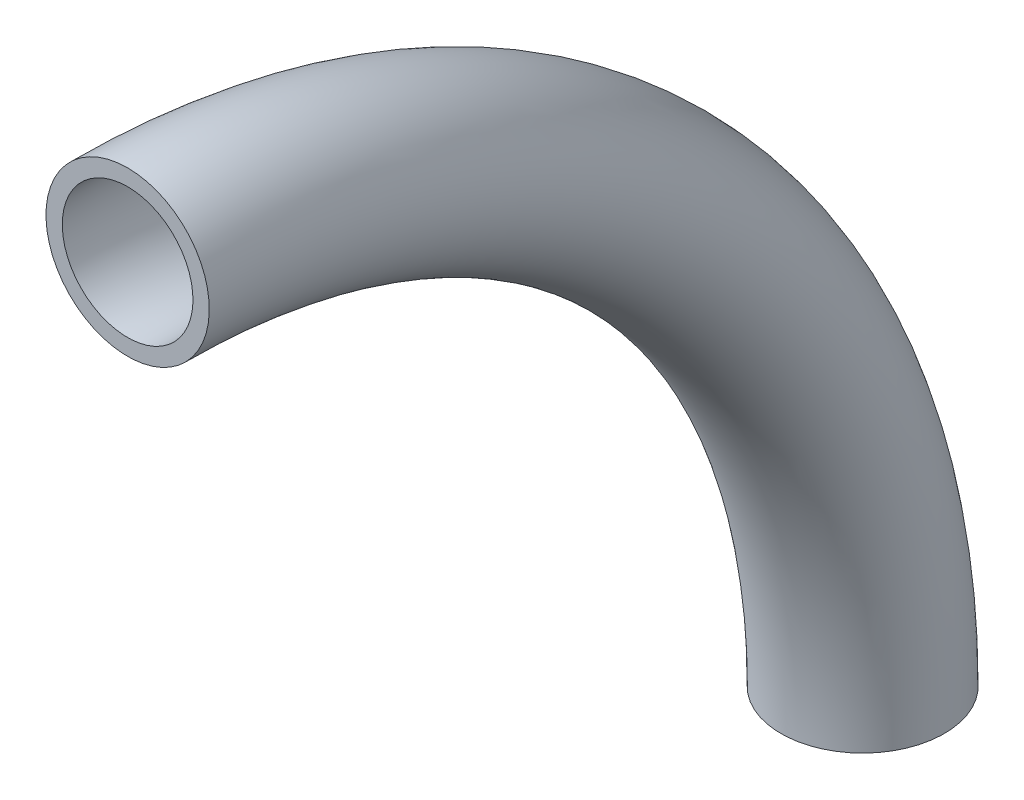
ISO-10303-21;
HEADER;
FILE_DESCRIPTION(('STEP AP214'),'2;1');
FILE_NAME('part.step','',(''),(''),'','','');
FILE_SCHEMA(('AUTOMOTIVE_DESIGN { 1 0 10303 214 1 1 1 1 }'));
ENDSEC;
DATA;
#1=APPLICATION_CONTEXT('core data for automotive mechanical design processes');
#2=APPLICATION_PROTOCOL_DEFINITION('international standard','automotive_design',2000,#1);
#3=PRODUCT_CONTEXT('',#1,'mechanical');
#4=PRODUCT('Part','Part','',(#3));
#5=PRODUCT_RELATED_PRODUCT_CATEGORY('part','',(#4));
#6=PRODUCT_DEFINITION_FORMATION('','',#4);
#7=PRODUCT_DEFINITION_CONTEXT('part definition',#1,'design');
#8=PRODUCT_DEFINITION('design','',#6,#7);
#9=PRODUCT_DEFINITION_SHAPE('','',#8);
#10=(LENGTH_UNIT() NAMED_UNIT(*) SI_UNIT(.MILLI.,.METRE.));
#11=(NAMED_UNIT(*) PLANE_ANGLE_UNIT() SI_UNIT($,.RADIAN.));
#12=(NAMED_UNIT(*) SI_UNIT($,.STERADIAN.) SOLID_ANGLE_UNIT());
#13=UNCERTAINTY_MEASURE_WITH_UNIT(LENGTH_MEASURE(1.E-05),#10,'distance_accuracy_value','');
#14=(GEOMETRIC_REPRESENTATION_CONTEXT(3) GLOBAL_UNCERTAINTY_ASSIGNED_CONTEXT((#13)) GLOBAL_UNIT_ASSIGNED_CONTEXT((#10,
#11,#12)) REPRESENTATION_CONTEXT('',''));
#15=CARTESIAN_POINT('',(0.,0.,0.));
#16=DIRECTION('',(0.,0.,1.));
#17=DIRECTION('',(1.,0.,0.));
#18=AXIS2_PLACEMENT_3D('',#15,#16,#17);
#19=CARTESIAN_POINT('',(0.,0.,4.5));
#20=DIRECTION('',(-1.,0.,0.));
#21=DIRECTION('',(0.,0.,1.));
#22=AXIS2_PLACEMENT_3D('',#19,#20,#21);
#23=TOROIDAL_SURFACE('',#22,4.5,0.5);
#24=CARTESIAN_POINT('',(0.,4.5,4.50000000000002));
#25=DIRECTION('',(0.,0.,1.));
#26=DIRECTION('',(0.,-1.,0.));
#27=AXIS2_PLACEMENT_3D('',#24,#25,#26);
#28=CIRCLE('',#27,0.5);
#29=CARTESIAN_POINT('',(0.,5.,4.50000000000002));
#30=VERTEX_POINT('',#29);
#31=EDGE_CURVE('E38',#30,#30,#28,.T.);
#32=CARTESIAN_POINT('',(0.,0.,0.));
#33=DIRECTION('',(0.,1.,0.));
#34=DIRECTION('',(0.,0.,1.));
#35=AXIS2_PLACEMENT_3D('',#32,#33,#34);
#36=CIRCLE('',#35,0.5);
#37=CARTESIAN_POINT('',(0.,0.,-0.5));
#38=VERTEX_POINT('',#37);
#39=EDGE_CURVE('E46',#38,#38,#36,.T.);
#40=CARTESIAN_POINT('',(0.,0.,4.5));
#41=DIRECTION('',(-1.,0.,0.));
#42=DIRECTION('',(0.,0.,1.));
#43=AXIS2_PLACEMENT_3D('',#40,#41,#42);
#44=CIRCLE('',#43,5.);
#45=EDGE_CURVE('',#30,#38,#44,.T.);
#46=ORIENTED_EDGE('',*,*,#31,.F.);
#47=ORIENTED_EDGE('',*,*,#39,.T.);
#48=ORIENTED_EDGE('',*,*,#45,.T.);
#49=ORIENTED_EDGE('',*,*,#45,.F.);
#50=EDGE_LOOP('',(#46,#48,#47,#49));
#51=FACE_BOUND('',#50,.T.);
#52=ADVANCED_FACE('F31',(#51),#23,.T.);
#53=CARTESIAN_POINT('',(0.,0.,4.5));
#54=DIRECTION('',(-1.,0.,0.));
#55=DIRECTION('',(0.,0.,1.));
#56=AXIS2_PLACEMENT_3D('',#53,#54,#55);
#57=TOROIDAL_SURFACE('',#56,4.5,0.4);
#58=CARTESIAN_POINT('',(0.,4.5,4.50000000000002));
#59=DIRECTION('',(0.,0.,1.));
#60=DIRECTION('',(0.,-1.,0.));
#61=AXIS2_PLACEMENT_3D('',#58,#59,#60);
#62=CIRCLE('',#61,0.4);
#63=CARTESIAN_POINT('',(0.,4.9,4.50000000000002));
#64=VERTEX_POINT('',#63);
#65=EDGE_CURVE('E10',#64,#64,#62,.T.);
#66=CARTESIAN_POINT('',(0.,0.,0.));
#67=DIRECTION('',(0.,1.,0.));
#68=DIRECTION('',(0.,0.,1.));
#69=AXIS2_PLACEMENT_3D('',#66,#67,#68);
#70=CIRCLE('',#69,0.4);
#71=CARTESIAN_POINT('',(0.,0.,-0.4));
#72=VERTEX_POINT('',#71);
#73=EDGE_CURVE('E42',#72,#72,#70,.T.);
#74=CARTESIAN_POINT('',(0.,0.,4.5));
#75=DIRECTION('',(-1.,0.,0.));
#76=DIRECTION('',(0.,0.,1.));
#77=AXIS2_PLACEMENT_3D('',#74,#75,#76);
#78=CIRCLE('',#77,4.9);
#79=EDGE_CURVE('',#64,#72,#78,.T.);
#80=ORIENTED_EDGE('',*,*,#65,.T.);
#81=ORIENTED_EDGE('',*,*,#73,.F.);
#82=ORIENTED_EDGE('',*,*,#79,.T.);
#83=ORIENTED_EDGE('',*,*,#79,.F.);
#84=EDGE_LOOP('',(#80,#82,#81,#83));
#85=FACE_BOUND('',#84,.T.);
#86=ADVANCED_FACE('F33',(#85),#57,.F.);
#87=CARTESIAN_POINT('',(-4.74370075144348,2.17186377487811,4.50000000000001));
#88=DIRECTION('',(0.,0.,1.));
#89=DIRECTION('',(0.,-1.,0.));
#90=AXIS2_PLACEMENT_3D('',#87,#88,#89);
#91=PLANE('',#90);
#92=ORIENTED_EDGE('',*,*,#31,.T.);
#93=EDGE_LOOP('',(#92));
#94=FACE_BOUND('',#93,.T.);
#95=ORIENTED_EDGE('',*,*,#65,.F.);
#96=EDGE_LOOP('',(#95));
#97=FACE_BOUND('',#96,.T.);
#98=ADVANCED_FACE('F56',(#94,#97),#91,.T.);
#99=CARTESIAN_POINT('',(-4.74370075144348,0.,2.32813622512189));
#100=DIRECTION('',(0.,1.,0.));
#101=DIRECTION('',(0.,0.,1.));
#102=AXIS2_PLACEMENT_3D('',#99,#100,#101);
#103=PLANE('',#102);
#104=ORIENTED_EDGE('',*,*,#39,.F.);
#105=EDGE_LOOP('',(#104));
#106=FACE_BOUND('',#105,.T.);
#107=ORIENTED_EDGE('',*,*,#73,.T.);
#108=EDGE_LOOP('',(#107));
#109=FACE_BOUND('',#108,.T.);
#110=ADVANCED_FACE('F53',(#106,#109),#103,.F.);
#111=CLOSED_SHELL('',(#52,#86,#98,#110));
#112=MANIFOLD_SOLID_BREP('B2',#111);
#113=ADVANCED_BREP_SHAPE_REPRESENTATION('',(#18,#112),#14);
#114=SHAPE_DEFINITION_REPRESENTATION(#9,#113);
ENDSEC;
END-ISO-10303-21;
